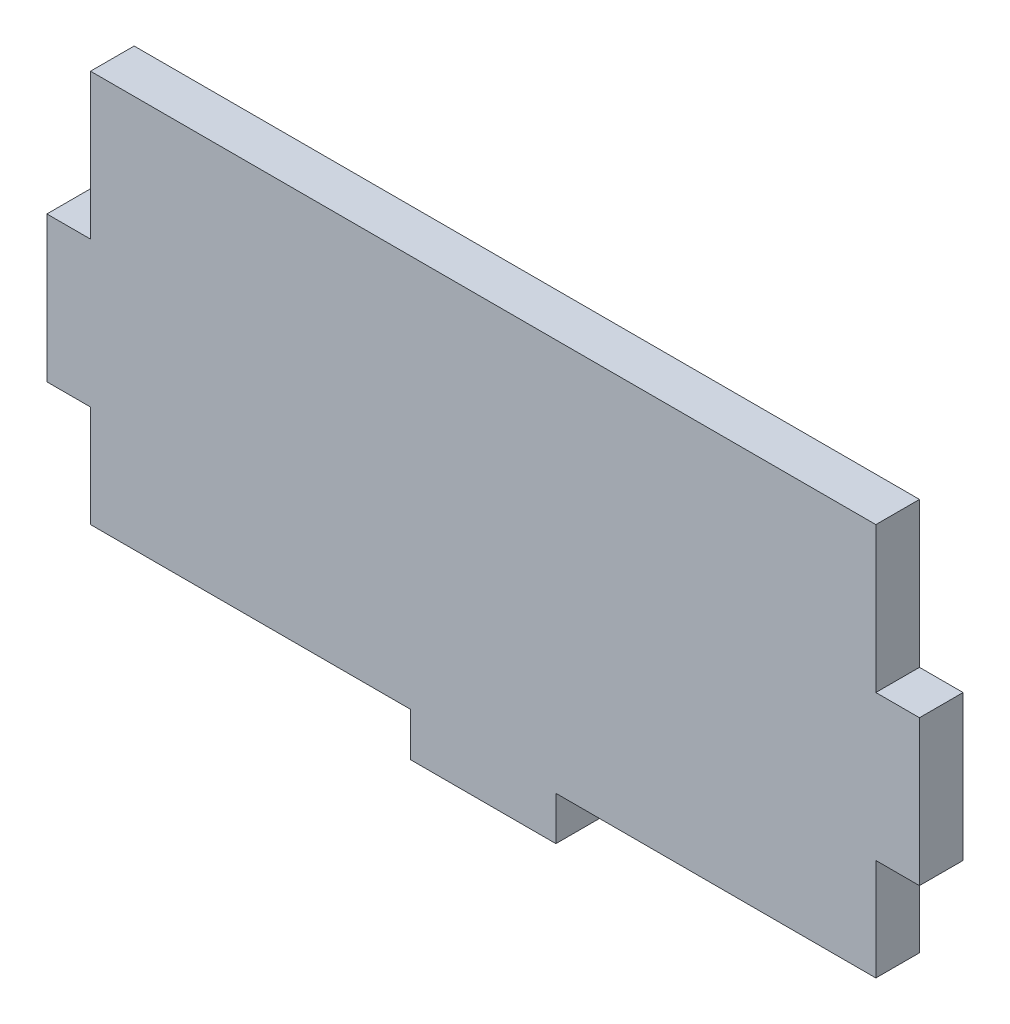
ISO-10303-21;
HEADER;
FILE_DESCRIPTION(('STEP AP214'),'2;1');
FILE_NAME('part.step','',(''),(''),'','','');
FILE_SCHEMA(('AUTOMOTIVE_DESIGN { 1 0 10303 214 1 1 1 1 }'));
ENDSEC;
DATA;
#1=APPLICATION_CONTEXT('core data for automotive mechanical design processes');
#2=APPLICATION_PROTOCOL_DEFINITION('international standard','automotive_design',2000,#1);
#3=PRODUCT_CONTEXT('',#1,'mechanical');
#4=PRODUCT('Part','Part','',(#3));
#5=PRODUCT_RELATED_PRODUCT_CATEGORY('part','',(#4));
#6=PRODUCT_DEFINITION_FORMATION('','',#4);
#7=PRODUCT_DEFINITION_CONTEXT('part definition',#1,'design');
#8=PRODUCT_DEFINITION('design','',#6,#7);
#9=PRODUCT_DEFINITION_SHAPE('','',#8);
#10=(LENGTH_UNIT() NAMED_UNIT(*) SI_UNIT(.MILLI.,.METRE.));
#11=(NAMED_UNIT(*) PLANE_ANGLE_UNIT() SI_UNIT($,.RADIAN.));
#12=(NAMED_UNIT(*) SI_UNIT($,.STERADIAN.) SOLID_ANGLE_UNIT());
#13=UNCERTAINTY_MEASURE_WITH_UNIT(LENGTH_MEASURE(1.E-05),#10,'distance_accuracy_value','');
#14=(GEOMETRIC_REPRESENTATION_CONTEXT(3) GLOBAL_UNCERTAINTY_ASSIGNED_CONTEXT((#13)) GLOBAL_UNIT_ASSIGNED_CONTEXT((#10,
#11,#12)) REPRESENTATION_CONTEXT('',''));
#15=CARTESIAN_POINT('',(0.,0.,0.));
#16=DIRECTION('',(0.,0.,1.));
#17=DIRECTION('',(1.,0.,0.));
#18=AXIS2_PLACEMENT_3D('',#15,#16,#17);
#19=CARTESIAN_POINT('',(-35.3576595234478,-19.4336800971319,3.));
#20=DIRECTION('',(-1.,0.,0.));
#21=DIRECTION('',(0.,0.,1.));
#22=AXIS2_PLACEMENT_3D('',#19,#20,#21);
#23=PLANE('',#22);
#24=DIRECTION('',(0.,1.,0.));
#25=VECTOR('',#24,1.);
#26=CARTESIAN_POINT('',(-35.3576595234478,-19.4336800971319,0.));
#27=LINE('',#26,#25);
#28=CARTESIAN_POINT('',(-35.3576595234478,-29.4336800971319,0.));
#29=VERTEX_POINT('',#28);
#30=CARTESIAN_POINT('',(-35.3576595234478,-19.4336800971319,0.));
#31=VERTEX_POINT('',#30);
#32=EDGE_CURVE('E177',#29,#31,#27,.T.);
#33=ORIENTED_EDGE('',*,*,#32,.T.);
#34=DIRECTION('',(0.,0.,-1.));
#35=VECTOR('',#34,1.);
#36=CARTESIAN_POINT('',(-35.3576595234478,-19.4336800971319,3.));
#37=LINE('',#36,#35);
#38=CARTESIAN_POINT('',(-35.3576595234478,-19.4336800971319,3.));
#39=VERTEX_POINT('',#38);
#40=EDGE_CURVE('E11',#39,#31,#37,.T.);
#41=ORIENTED_EDGE('',*,*,#40,.F.);
#42=DIRECTION('',(0.,1.,0.));
#43=VECTOR('',#42,1.);
#44=CARTESIAN_POINT('',(-35.3576595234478,-19.4336800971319,3.));
#45=LINE('',#44,#43);
#46=CARTESIAN_POINT('',(-35.3576595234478,-29.4336800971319,3.));
#47=VERTEX_POINT('',#46);
#48=EDGE_CURVE('E207',#47,#39,#45,.T.);
#49=ORIENTED_EDGE('',*,*,#48,.F.);
#50=DIRECTION('',(0.,0.,-1.));
#51=VECTOR('',#50,1.);
#52=CARTESIAN_POINT('',(-35.3576595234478,-29.4336800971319,3.));
#53=LINE('',#52,#51);
#54=EDGE_CURVE('E173',#47,#29,#53,.T.);
#55=ORIENTED_EDGE('',*,*,#54,.T.);
#56=EDGE_LOOP('',(#33,#41,#49,#55));
#57=FACE_BOUND('',#56,.T.);
#58=ADVANCED_FACE('F33',(#57),#23,.F.);
#59=CARTESIAN_POINT('',(-89.3576595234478,-19.4336800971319,3.));
#60=DIRECTION('',(0.,-1.,0.));
#61=DIRECTION('',(0.,0.,-1.));
#62=AXIS2_PLACEMENT_3D('',#59,#60,#61);
#63=PLANE('',#62);
#64=DIRECTION('',(-1.,0.,0.));
#65=VECTOR('',#64,1.);
#66=CARTESIAN_POINT('',(-89.3576595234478,-19.4336800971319,0.));
#67=LINE('',#66,#65);
#68=CARTESIAN_POINT('',(-89.3576595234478,-19.4336800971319,0.));
#69=VERTEX_POINT('',#68);
#70=EDGE_CURVE('E180',#31,#69,#67,.T.);
#71=ORIENTED_EDGE('',*,*,#70,.T.);
#72=DIRECTION('',(0.,0.,-1.));
#73=VECTOR('',#72,1.);
#74=CARTESIAN_POINT('',(-89.3576595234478,-19.4336800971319,3.));
#75=LINE('',#74,#73);
#76=CARTESIAN_POINT('',(-89.3576595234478,-19.4336800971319,3.));
#77=VERTEX_POINT('',#76);
#78=EDGE_CURVE('E41',#77,#69,#75,.T.);
#79=ORIENTED_EDGE('',*,*,#78,.F.);
#80=DIRECTION('',(-1.,0.,0.));
#81=VECTOR('',#80,1.);
#82=CARTESIAN_POINT('',(-89.3576595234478,-19.4336800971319,3.));
#83=LINE('',#82,#81);
#84=EDGE_CURVE('E116',#39,#77,#83,.T.);
#85=ORIENTED_EDGE('',*,*,#84,.F.);
#86=ORIENTED_EDGE('',*,*,#40,.T.);
#87=EDGE_LOOP('',(#71,#79,#85,#86));
#88=FACE_BOUND('',#87,.T.);
#89=ADVANCED_FACE('F305',(#88),#63,.F.);
#90=CARTESIAN_POINT('',(-89.3576595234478,-19.4336800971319,3.));
#91=DIRECTION('',(1.,0.,0.));
#92=DIRECTION('',(0.,0.,-1.));
#93=AXIS2_PLACEMENT_3D('',#90,#91,#92);
#94=PLANE('',#93);
#95=DIRECTION('',(0.,-1.,0.));
#96=VECTOR('',#95,1.);
#97=CARTESIAN_POINT('',(-89.3576595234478,-19.4336800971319,0.));
#98=LINE('',#97,#96);
#99=CARTESIAN_POINT('',(-89.3576595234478,-29.4336800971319,0.));
#100=VERTEX_POINT('',#99);
#101=EDGE_CURVE('E182',#69,#100,#98,.T.);
#102=ORIENTED_EDGE('',*,*,#101,.T.);
#103=DIRECTION('',(0.,0.,-1.));
#104=VECTOR('',#103,1.);
#105=CARTESIAN_POINT('',(-89.3576595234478,-29.4336800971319,3.));
#106=LINE('',#105,#104);
#107=CARTESIAN_POINT('',(-89.3576595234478,-29.4336800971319,3.));
#108=VERTEX_POINT('',#107);
#109=EDGE_CURVE('E238',#108,#100,#106,.T.);
#110=ORIENTED_EDGE('',*,*,#109,.F.);
#111=DIRECTION('',(0.,-1.,0.));
#112=VECTOR('',#111,1.);
#113=CARTESIAN_POINT('',(-89.3576595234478,-19.4336800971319,3.));
#114=LINE('',#113,#112);
#115=EDGE_CURVE('E246',#77,#108,#114,.T.);
#116=ORIENTED_EDGE('',*,*,#115,.F.);
#117=ORIENTED_EDGE('',*,*,#78,.T.);
#118=EDGE_LOOP('',(#102,#110,#116,#117));
#119=FACE_BOUND('',#118,.T.);
#120=ADVANCED_FACE('F244',(#119),#94,.F.);
#121=CARTESIAN_POINT('',(-92.3576595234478,-29.4336800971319,3.));
#122=DIRECTION('',(0.,-1.,0.));
#123=DIRECTION('',(0.,0.,-1.));
#124=AXIS2_PLACEMENT_3D('',#121,#122,#123);
#125=PLANE('',#124);
#126=DIRECTION('',(-1.,0.,0.));
#127=VECTOR('',#126,1.);
#128=CARTESIAN_POINT('',(-92.3576595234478,-29.4336800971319,0.));
#129=LINE('',#128,#127);
#130=CARTESIAN_POINT('',(-92.3576595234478,-29.4336800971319,0.));
#131=VERTEX_POINT('',#130);
#132=EDGE_CURVE('E184',#100,#131,#129,.T.);
#133=ORIENTED_EDGE('',*,*,#132,.T.);
#134=DIRECTION('',(0.,0.,-1.));
#135=VECTOR('',#134,1.);
#136=CARTESIAN_POINT('',(-92.3576595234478,-29.4336800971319,3.));
#137=LINE('',#136,#135);
#138=CARTESIAN_POINT('',(-92.3576595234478,-29.4336800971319,3.));
#139=VERTEX_POINT('',#138);
#140=EDGE_CURVE('E235',#139,#131,#137,.T.);
#141=ORIENTED_EDGE('',*,*,#140,.F.);
#142=DIRECTION('',(-1.,0.,0.));
#143=VECTOR('',#142,1.);
#144=CARTESIAN_POINT('',(-92.3576595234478,-29.4336800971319,3.));
#145=LINE('',#144,#143);
#146=EDGE_CURVE('E264',#108,#139,#145,.T.);
#147=ORIENTED_EDGE('',*,*,#146,.F.);
#148=ORIENTED_EDGE('',*,*,#109,.T.);
#149=EDGE_LOOP('',(#133,#141,#147,#148));
#150=FACE_BOUND('',#149,.T.);
#151=ADVANCED_FACE('F255',(#150),#125,.F.);
#152=CARTESIAN_POINT('',(-92.3576595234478,-29.4336800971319,3.));
#153=DIRECTION('',(1.,0.,0.));
#154=DIRECTION('',(0.,0.,-1.));
#155=AXIS2_PLACEMENT_3D('',#152,#153,#154);
#156=PLANE('',#155);
#157=DIRECTION('',(0.,-1.,0.));
#158=VECTOR('',#157,1.);
#159=CARTESIAN_POINT('',(-92.3576595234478,-29.4336800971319,0.));
#160=LINE('',#159,#158);
#161=CARTESIAN_POINT('',(-92.3576595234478,-39.4336800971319,0.));
#162=VERTEX_POINT('',#161);
#163=EDGE_CURVE('E186',#131,#162,#160,.T.);
#164=ORIENTED_EDGE('',*,*,#163,.T.);
#165=DIRECTION('',(0.,0.,-1.));
#166=VECTOR('',#165,1.);
#167=CARTESIAN_POINT('',(-92.3576595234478,-39.4336800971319,3.));
#168=LINE('',#167,#166);
#169=CARTESIAN_POINT('',(-92.3576595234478,-39.4336800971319,3.));
#170=VERTEX_POINT('',#169);
#171=EDGE_CURVE('E232',#170,#162,#168,.T.);
#172=ORIENTED_EDGE('',*,*,#171,.F.);
#173=DIRECTION('',(0.,-1.,0.));
#174=VECTOR('',#173,1.);
#175=CARTESIAN_POINT('',(-92.3576595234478,-29.4336800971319,3.));
#176=LINE('',#175,#174);
#177=EDGE_CURVE('E261',#139,#170,#176,.T.);
#178=ORIENTED_EDGE('',*,*,#177,.F.);
#179=ORIENTED_EDGE('',*,*,#140,.T.);
#180=EDGE_LOOP('',(#164,#172,#178,#179));
#181=FACE_BOUND('',#180,.T.);
#182=ADVANCED_FACE('F259',(#181),#156,.F.);
#183=CARTESIAN_POINT('',(-92.3576595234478,-39.4336800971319,3.));
#184=DIRECTION('',(0.,1.,0.));
#185=DIRECTION('',(0.,0.,1.));
#186=AXIS2_PLACEMENT_3D('',#183,#184,#185);
#187=PLANE('',#186);
#188=DIRECTION('',(1.,0.,0.));
#189=VECTOR('',#188,1.);
#190=CARTESIAN_POINT('',(-92.3576595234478,-39.4336800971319,0.));
#191=LINE('',#190,#189);
#192=CARTESIAN_POINT('',(-89.3576595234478,-39.4336800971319,0.));
#193=VERTEX_POINT('',#192);
#194=EDGE_CURVE('E188',#162,#193,#191,.T.);
#195=ORIENTED_EDGE('',*,*,#194,.T.);
#196=DIRECTION('',(0.,0.,-1.));
#197=VECTOR('',#196,1.);
#198=CARTESIAN_POINT('',(-89.3576595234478,-39.4336800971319,3.));
#199=LINE('',#198,#197);
#200=CARTESIAN_POINT('',(-89.3576595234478,-39.4336800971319,3.));
#201=VERTEX_POINT('',#200);
#202=EDGE_CURVE('E229',#201,#193,#199,.T.);
#203=ORIENTED_EDGE('',*,*,#202,.F.);
#204=DIRECTION('',(1.,0.,0.));
#205=VECTOR('',#204,1.);
#206=CARTESIAN_POINT('',(-92.3576595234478,-39.4336800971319,3.));
#207=LINE('',#206,#205);
#208=EDGE_CURVE('E263',#170,#201,#207,.T.);
#209=ORIENTED_EDGE('',*,*,#208,.F.);
#210=ORIENTED_EDGE('',*,*,#171,.T.);
#211=EDGE_LOOP('',(#195,#203,#209,#210));
#212=FACE_BOUND('',#211,.T.);
#213=ADVANCED_FACE('F318',(#212),#187,.F.);
#214=CARTESIAN_POINT('',(-89.3576595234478,-39.4336800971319,3.));
#215=DIRECTION('',(1.,0.,0.));
#216=DIRECTION('',(0.,0.,-1.));
#217=AXIS2_PLACEMENT_3D('',#214,#215,#216);
#218=PLANE('',#217);
#219=DIRECTION('',(0.,-1.,0.));
#220=VECTOR('',#219,1.);
#221=CARTESIAN_POINT('',(-89.3576595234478,-39.4336800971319,0.));
#222=LINE('',#221,#220);
#223=CARTESIAN_POINT('',(-89.3576595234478,-46.4336800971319,0.));
#224=VERTEX_POINT('',#223);
#225=EDGE_CURVE('E190',#193,#224,#222,.T.);
#226=ORIENTED_EDGE('',*,*,#225,.T.);
#227=DIRECTION('',(0.,0.,-1.));
#228=VECTOR('',#227,1.);
#229=CARTESIAN_POINT('',(-89.3576595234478,-46.4336800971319,3.));
#230=LINE('',#229,#228);
#231=CARTESIAN_POINT('',(-89.3576595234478,-46.4336800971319,3.));
#232=VERTEX_POINT('',#231);
#233=EDGE_CURVE('E226',#232,#224,#230,.T.);
#234=ORIENTED_EDGE('',*,*,#233,.F.);
#235=DIRECTION('',(0.,-1.,0.));
#236=VECTOR('',#235,1.);
#237=CARTESIAN_POINT('',(-89.3576595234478,-39.4336800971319,3.));
#238=LINE('',#237,#236);
#239=EDGE_CURVE('E266',#201,#232,#238,.T.);
#240=ORIENTED_EDGE('',*,*,#239,.F.);
#241=ORIENTED_EDGE('',*,*,#202,.T.);
#242=EDGE_LOOP('',(#226,#234,#240,#241));
#243=FACE_BOUND('',#242,.T.);
#244=ADVANCED_FACE('F321',(#243),#218,.F.);
#245=CARTESIAN_POINT('',(-89.3576595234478,-46.4336800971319,3.));
#246=DIRECTION('',(0.,1.,0.));
#247=DIRECTION('',(-1.,0.,0.));
#248=AXIS2_PLACEMENT_3D('',#245,#246,#247);
#249=PLANE('',#248);
#250=DIRECTION('',(1.,0.,0.));
#251=VECTOR('',#250,1.);
#252=CARTESIAN_POINT('',(-89.3576595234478,-46.4336800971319,0.));
#253=LINE('',#252,#251);
#254=CARTESIAN_POINT('',(-67.3576595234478,-46.4336800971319,0.));
#255=VERTEX_POINT('',#254);
#256=EDGE_CURVE('E192',#224,#255,#253,.T.);
#257=ORIENTED_EDGE('',*,*,#256,.T.);
#258=DIRECTION('',(0.,0.,-1.));
#259=VECTOR('',#258,1.);
#260=CARTESIAN_POINT('',(-67.3576595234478,-46.4336800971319,3.));
#261=LINE('',#260,#259);
#262=CARTESIAN_POINT('',(-67.3576595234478,-46.4336800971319,3.));
#263=VERTEX_POINT('',#262);
#264=EDGE_CURVE('E223',#263,#255,#261,.T.);
#265=ORIENTED_EDGE('',*,*,#264,.F.);
#266=DIRECTION('',(1.,0.,0.));
#267=VECTOR('',#266,1.);
#268=CARTESIAN_POINT('',(-89.3576595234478,-46.4336800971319,3.));
#269=LINE('',#268,#267);
#270=EDGE_CURVE('E272',#232,#263,#269,.T.);
#271=ORIENTED_EDGE('',*,*,#270,.F.);
#272=ORIENTED_EDGE('',*,*,#233,.T.);
#273=EDGE_LOOP('',(#257,#265,#271,#272));
#274=FACE_BOUND('',#273,.T.);
#275=ADVANCED_FACE('F325',(#274),#249,.F.);
#276=CARTESIAN_POINT('',(-67.3576595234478,-46.4336800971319,3.));
#277=DIRECTION('',(1.,0.,0.));
#278=DIRECTION('',(0.,0.,-1.));
#279=AXIS2_PLACEMENT_3D('',#276,#277,#278);
#280=PLANE('',#279);
#281=DIRECTION('',(0.,-1.,0.));
#282=VECTOR('',#281,1.);
#283=CARTESIAN_POINT('',(-67.3576595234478,-46.4336800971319,0.));
#284=LINE('',#283,#282);
#285=CARTESIAN_POINT('',(-67.3576595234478,-49.4336800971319,0.));
#286=VERTEX_POINT('',#285);
#287=EDGE_CURVE('E194',#255,#286,#284,.T.);
#288=ORIENTED_EDGE('',*,*,#287,.T.);
#289=DIRECTION('',(0.,0.,-1.));
#290=VECTOR('',#289,1.);
#291=CARTESIAN_POINT('',(-67.3576595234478,-49.4336800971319,3.));
#292=LINE('',#291,#290);
#293=CARTESIAN_POINT('',(-67.3576595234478,-49.4336800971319,3.));
#294=VERTEX_POINT('',#293);
#295=EDGE_CURVE('E220',#294,#286,#292,.T.);
#296=ORIENTED_EDGE('',*,*,#295,.F.);
#297=DIRECTION('',(0.,-1.,0.));
#298=VECTOR('',#297,1.);
#299=CARTESIAN_POINT('',(-67.3576595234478,-46.4336800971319,3.));
#300=LINE('',#299,#298);
#301=EDGE_CURVE('E274',#263,#294,#300,.T.);
#302=ORIENTED_EDGE('',*,*,#301,.F.);
#303=ORIENTED_EDGE('',*,*,#264,.T.);
#304=EDGE_LOOP('',(#288,#296,#302,#303));
#305=FACE_BOUND('',#304,.T.);
#306=ADVANCED_FACE('F329',(#305),#280,.F.);
#307=CARTESIAN_POINT('',(-67.3576595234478,-49.4336800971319,3.));
#308=DIRECTION('',(0.,1.,0.));
#309=DIRECTION('',(0.,0.,1.));
#310=AXIS2_PLACEMENT_3D('',#307,#308,#309);
#311=PLANE('',#310);
#312=DIRECTION('',(1.,0.,0.));
#313=VECTOR('',#312,1.);
#314=CARTESIAN_POINT('',(-67.3576595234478,-49.4336800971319,0.));
#315=LINE('',#314,#313);
#316=CARTESIAN_POINT('',(-57.3576595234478,-49.4336800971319,0.));
#317=VERTEX_POINT('',#316);
#318=EDGE_CURVE('E196',#286,#317,#315,.T.);
#319=ORIENTED_EDGE('',*,*,#318,.T.);
#320=DIRECTION('',(0.,0.,-1.));
#321=VECTOR('',#320,1.);
#322=CARTESIAN_POINT('',(-57.3576595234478,-49.4336800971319,3.));
#323=LINE('',#322,#321);
#324=CARTESIAN_POINT('',(-57.3576595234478,-49.4336800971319,3.));
#325=VERTEX_POINT('',#324);
#326=EDGE_CURVE('E217',#325,#317,#323,.T.);
#327=ORIENTED_EDGE('',*,*,#326,.F.);
#328=DIRECTION('',(1.,0.,0.));
#329=VECTOR('',#328,1.);
#330=CARTESIAN_POINT('',(-67.3576595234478,-49.4336800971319,3.));
#331=LINE('',#330,#329);
#332=EDGE_CURVE('E276',#294,#325,#331,.T.);
#333=ORIENTED_EDGE('',*,*,#332,.F.);
#334=ORIENTED_EDGE('',*,*,#295,.T.);
#335=EDGE_LOOP('',(#319,#327,#333,#334));
#336=FACE_BOUND('',#335,.T.);
#337=ADVANCED_FACE('F333',(#336),#311,.F.);
#338=CARTESIAN_POINT('',(-57.3576595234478,-46.4336800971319,3.));
#339=DIRECTION('',(-1.,0.,0.));
#340=DIRECTION('',(0.,-1.,0.));
#341=AXIS2_PLACEMENT_3D('',#338,#339,#340);
#342=PLANE('',#341);
#343=DIRECTION('',(0.,1.,0.));
#344=VECTOR('',#343,1.);
#345=CARTESIAN_POINT('',(-57.3576595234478,-46.4336800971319,0.));
#346=LINE('',#345,#344);
#347=CARTESIAN_POINT('',(-57.3576595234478,-46.4336800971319,0.));
#348=VERTEX_POINT('',#347);
#349=EDGE_CURVE('E198',#317,#348,#346,.T.);
#350=ORIENTED_EDGE('',*,*,#349,.T.);
#351=DIRECTION('',(0.,0.,-1.));
#352=VECTOR('',#351,1.);
#353=CARTESIAN_POINT('',(-57.3576595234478,-46.4336800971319,3.));
#354=LINE('',#353,#352);
#355=CARTESIAN_POINT('',(-57.3576595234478,-46.4336800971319,3.));
#356=VERTEX_POINT('',#355);
#357=EDGE_CURVE('E214',#356,#348,#354,.T.);
#358=ORIENTED_EDGE('',*,*,#357,.F.);
#359=DIRECTION('',(0.,1.,0.));
#360=VECTOR('',#359,1.);
#361=CARTESIAN_POINT('',(-57.3576595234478,-46.4336800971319,3.));
#362=LINE('',#361,#360);
#363=EDGE_CURVE('E278',#325,#356,#362,.T.);
#364=ORIENTED_EDGE('',*,*,#363,.F.);
#365=ORIENTED_EDGE('',*,*,#326,.T.);
#366=EDGE_LOOP('',(#350,#358,#364,#365));
#367=FACE_BOUND('',#366,.T.);
#368=ADVANCED_FACE('F337',(#367),#342,.F.);
#369=CARTESIAN_POINT('',(-57.3576595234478,-46.4336800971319,3.));
#370=DIRECTION('',(0.,1.,0.));
#371=DIRECTION('',(-1.,0.,0.));
#372=AXIS2_PLACEMENT_3D('',#369,#370,#371);
#373=PLANE('',#372);
#374=DIRECTION('',(1.,0.,0.));
#375=VECTOR('',#374,1.);
#376=CARTESIAN_POINT('',(-57.3576595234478,-46.4336800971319,0.));
#377=LINE('',#376,#375);
#378=CARTESIAN_POINT('',(-35.3576595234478,-46.4336800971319,0.));
#379=VERTEX_POINT('',#378);
#380=EDGE_CURVE('E200',#348,#379,#377,.T.);
#381=ORIENTED_EDGE('',*,*,#380,.T.);
#382=DIRECTION('',(0.,0.,-1.));
#383=VECTOR('',#382,1.);
#384=CARTESIAN_POINT('',(-35.3576595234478,-46.4336800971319,3.));
#385=LINE('',#384,#383);
#386=CARTESIAN_POINT('',(-35.3576595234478,-46.4336800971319,3.));
#387=VERTEX_POINT('',#386);
#388=EDGE_CURVE('E211',#387,#379,#385,.T.);
#389=ORIENTED_EDGE('',*,*,#388,.F.);
#390=DIRECTION('',(1.,0.,0.));
#391=VECTOR('',#390,1.);
#392=CARTESIAN_POINT('',(-57.3576595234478,-46.4336800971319,3.));
#393=LINE('',#392,#391);
#394=EDGE_CURVE('E280',#356,#387,#393,.T.);
#395=ORIENTED_EDGE('',*,*,#394,.F.);
#396=ORIENTED_EDGE('',*,*,#357,.T.);
#397=EDGE_LOOP('',(#381,#389,#395,#396));
#398=FACE_BOUND('',#397,.T.);
#399=ADVANCED_FACE('F286',(#398),#373,.F.);
#400=CARTESIAN_POINT('',(-35.3576595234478,-39.4336800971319,3.));
#401=DIRECTION('',(-1.,0.,0.));
#402=DIRECTION('',(0.,-1.,0.));
#403=AXIS2_PLACEMENT_3D('',#400,#401,#402);
#404=PLANE('',#403);
#405=DIRECTION('',(0.,1.,0.));
#406=VECTOR('',#405,1.);
#407=CARTESIAN_POINT('',(-35.3576595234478,-39.4336800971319,0.));
#408=LINE('',#407,#406);
#409=CARTESIAN_POINT('',(-35.3576595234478,-39.4336800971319,0.));
#410=VERTEX_POINT('',#409);
#411=EDGE_CURVE('E202',#379,#410,#408,.T.);
#412=ORIENTED_EDGE('',*,*,#411,.T.);
#413=DIRECTION('',(0.,0.,-1.));
#414=VECTOR('',#413,1.);
#415=CARTESIAN_POINT('',(-35.3576595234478,-39.4336800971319,3.));
#416=LINE('',#415,#414);
#417=CARTESIAN_POINT('',(-35.3576595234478,-39.4336800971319,3.));
#418=VERTEX_POINT('',#417);
#419=EDGE_CURVE('E168',#418,#410,#416,.T.);
#420=ORIENTED_EDGE('',*,*,#419,.F.);
#421=DIRECTION('',(0.,1.,0.));
#422=VECTOR('',#421,1.);
#423=CARTESIAN_POINT('',(-35.3576595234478,-39.4336800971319,3.));
#424=LINE('',#423,#422);
#425=EDGE_CURVE('E159',#387,#418,#424,.T.);
#426=ORIENTED_EDGE('',*,*,#425,.F.);
#427=ORIENTED_EDGE('',*,*,#388,.T.);
#428=EDGE_LOOP('',(#412,#420,#426,#427));
#429=FACE_BOUND('',#428,.T.);
#430=ADVANCED_FACE('F290',(#429),#404,.F.);
#431=CARTESIAN_POINT('',(-32.3576595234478,-39.4336800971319,3.));
#432=DIRECTION('',(0.,1.,0.));
#433=DIRECTION('',(0.,0.,1.));
#434=AXIS2_PLACEMENT_3D('',#431,#432,#433);
#435=PLANE('',#434);
#436=DIRECTION('',(1.,0.,0.));
#437=VECTOR('',#436,1.);
#438=CARTESIAN_POINT('',(-32.3576595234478,-39.4336800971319,0.));
#439=LINE('',#438,#437);
#440=CARTESIAN_POINT('',(-32.3576595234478,-39.4336800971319,0.));
#441=VERTEX_POINT('',#440);
#442=EDGE_CURVE('E167',#410,#441,#439,.T.);
#443=ORIENTED_EDGE('',*,*,#442,.T.);
#444=DIRECTION('',(0.,0.,-1.));
#445=VECTOR('',#444,1.);
#446=CARTESIAN_POINT('',(-32.3576595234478,-39.4336800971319,3.));
#447=LINE('',#446,#445);
#448=CARTESIAN_POINT('',(-32.3576595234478,-39.4336800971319,3.));
#449=VERTEX_POINT('',#448);
#450=EDGE_CURVE('E164',#449,#441,#447,.T.);
#451=ORIENTED_EDGE('',*,*,#450,.F.);
#452=DIRECTION('',(1.,0.,0.));
#453=VECTOR('',#452,1.);
#454=CARTESIAN_POINT('',(-32.3576595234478,-39.4336800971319,3.));
#455=LINE('',#454,#453);
#456=EDGE_CURVE('E153',#418,#449,#455,.T.);
#457=ORIENTED_EDGE('',*,*,#456,.F.);
#458=ORIENTED_EDGE('',*,*,#419,.T.);
#459=EDGE_LOOP('',(#443,#451,#457,#458));
#460=FACE_BOUND('',#459,.T.);
#461=ADVANCED_FACE('F165',(#460),#435,.F.);
#462=CARTESIAN_POINT('',(-32.3576595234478,-29.4336800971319,3.));
#463=DIRECTION('',(-1.,0.,0.));
#464=DIRECTION('',(0.,-1.,0.));
#465=AXIS2_PLACEMENT_3D('',#462,#463,#464);
#466=PLANE('',#465);
#467=DIRECTION('',(0.,1.,0.));
#468=VECTOR('',#467,1.);
#469=CARTESIAN_POINT('',(-32.3576595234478,-29.4336800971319,0.));
#470=LINE('',#469,#468);
#471=CARTESIAN_POINT('',(-32.3576595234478,-29.4336800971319,0.));
#472=VERTEX_POINT('',#471);
#473=EDGE_CURVE('E102',#441,#472,#470,.T.);
#474=ORIENTED_EDGE('',*,*,#473,.T.);
#475=DIRECTION('',(0.,0.,-1.));
#476=VECTOR('',#475,1.);
#477=CARTESIAN_POINT('',(-32.3576595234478,-29.4336800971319,3.));
#478=LINE('',#477,#476);
#479=CARTESIAN_POINT('',(-32.3576595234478,-29.4336800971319,3.));
#480=VERTEX_POINT('',#479);
#481=EDGE_CURVE('E169',#480,#472,#478,.T.);
#482=ORIENTED_EDGE('',*,*,#481,.F.);
#483=DIRECTION('',(0.,1.,0.));
#484=VECTOR('',#483,1.);
#485=CARTESIAN_POINT('',(-32.3576595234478,-29.4336800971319,3.));
#486=LINE('',#485,#484);
#487=EDGE_CURVE('E157',#449,#480,#486,.T.);
#488=ORIENTED_EDGE('',*,*,#487,.F.);
#489=ORIENTED_EDGE('',*,*,#450,.T.);
#490=EDGE_LOOP('',(#474,#482,#488,#489));
#491=FACE_BOUND('',#490,.T.);
#492=ADVANCED_FACE('F171',(#491),#466,.F.);
#493=CARTESIAN_POINT('',(-32.3576595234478,-29.4336800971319,3.));
#494=DIRECTION('',(0.,-1.,0.));
#495=DIRECTION('',(0.,0.,-1.));
#496=AXIS2_PLACEMENT_3D('',#493,#494,#495);
#497=PLANE('',#496);
#498=DIRECTION('',(-1.,0.,0.));
#499=VECTOR('',#498,1.);
#500=CARTESIAN_POINT('',(-32.3576595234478,-29.4336800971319,0.));
#501=LINE('',#500,#499);
#502=EDGE_CURVE('E108',#472,#29,#501,.T.);
#503=ORIENTED_EDGE('',*,*,#502,.T.);
#504=ORIENTED_EDGE('',*,*,#54,.F.);
#505=DIRECTION('',(-1.,0.,0.));
#506=VECTOR('',#505,1.);
#507=CARTESIAN_POINT('',(-32.3576595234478,-29.4336800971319,3.));
#508=LINE('',#507,#506);
#509=EDGE_CURVE('E49',#480,#47,#508,.T.);
#510=ORIENTED_EDGE('',*,*,#509,.F.);
#511=ORIENTED_EDGE('',*,*,#481,.T.);
#512=EDGE_LOOP('',(#503,#504,#510,#511));
#513=FACE_BOUND('',#512,.T.);
#514=ADVANCED_FACE('F294',(#513),#497,.F.);
#515=CARTESIAN_POINT('',(-35.3576595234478,-29.4336800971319,3.));
#516=DIRECTION('',(0.,0.,-1.));
#517=DIRECTION('',(-1.,0.,0.));
#518=AXIS2_PLACEMENT_3D('',#515,#516,#517);
#519=PLANE('',#518);
#520=ORIENTED_EDGE('',*,*,#48,.T.);
#521=ORIENTED_EDGE('',*,*,#84,.T.);
#522=ORIENTED_EDGE('',*,*,#115,.T.);
#523=ORIENTED_EDGE('',*,*,#146,.T.);
#524=ORIENTED_EDGE('',*,*,#177,.T.);
#525=ORIENTED_EDGE('',*,*,#208,.T.);
#526=ORIENTED_EDGE('',*,*,#239,.T.);
#527=ORIENTED_EDGE('',*,*,#270,.T.);
#528=ORIENTED_EDGE('',*,*,#301,.T.);
#529=ORIENTED_EDGE('',*,*,#332,.T.);
#530=ORIENTED_EDGE('',*,*,#363,.T.);
#531=ORIENTED_EDGE('',*,*,#394,.T.);
#532=ORIENTED_EDGE('',*,*,#425,.T.);
#533=ORIENTED_EDGE('',*,*,#456,.T.);
#534=ORIENTED_EDGE('',*,*,#487,.T.);
#535=ORIENTED_EDGE('',*,*,#509,.T.);
#536=EDGE_LOOP('',(#520,#521,#522,#523,#524,#525,#526,#527,#528,#529,#530,#531,#532,#533,#534,#535));
#537=FACE_BOUND('',#536,.T.);
#538=ADVANCED_FACE('F155',(#537),#519,.F.);
#539=CARTESIAN_POINT('',(-35.3576595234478,-29.4336800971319,0.));
#540=DIRECTION('',(0.,0.,-1.));
#541=DIRECTION('',(-1.,0.,0.));
#542=AXIS2_PLACEMENT_3D('',#539,#540,#541);
#543=PLANE('',#542);
#544=ORIENTED_EDGE('',*,*,#32,.F.);
#545=ORIENTED_EDGE('',*,*,#502,.F.);
#546=ORIENTED_EDGE('',*,*,#473,.F.);
#547=ORIENTED_EDGE('',*,*,#442,.F.);
#548=ORIENTED_EDGE('',*,*,#411,.F.);
#549=ORIENTED_EDGE('',*,*,#380,.F.);
#550=ORIENTED_EDGE('',*,*,#349,.F.);
#551=ORIENTED_EDGE('',*,*,#318,.F.);
#552=ORIENTED_EDGE('',*,*,#287,.F.);
#553=ORIENTED_EDGE('',*,*,#256,.F.);
#554=ORIENTED_EDGE('',*,*,#225,.F.);
#555=ORIENTED_EDGE('',*,*,#194,.F.);
#556=ORIENTED_EDGE('',*,*,#163,.F.);
#557=ORIENTED_EDGE('',*,*,#132,.F.);
#558=ORIENTED_EDGE('',*,*,#101,.F.);
#559=ORIENTED_EDGE('',*,*,#70,.F.);
#560=EDGE_LOOP('',(#544,#545,#546,#547,#548,#549,#550,#551,#552,#553,#554,#555,#556,#557,#558,#559));
#561=FACE_BOUND('',#560,.T.);
#562=ADVANCED_FACE('F250',(#561),#543,.T.);
#563=CLOSED_SHELL('',(#58,#89,#120,#151,#182,#213,#244,#275,#306,#337,#368,#399,#430,#461,#492,
#514,#538,#562));
#564=MANIFOLD_SOLID_BREP('B2',#563);
#565=ADVANCED_BREP_SHAPE_REPRESENTATION('',(#18,#564),#14);
#566=SHAPE_DEFINITION_REPRESENTATION(#9,#565);
ENDSEC;
END-ISO-10303-21;
